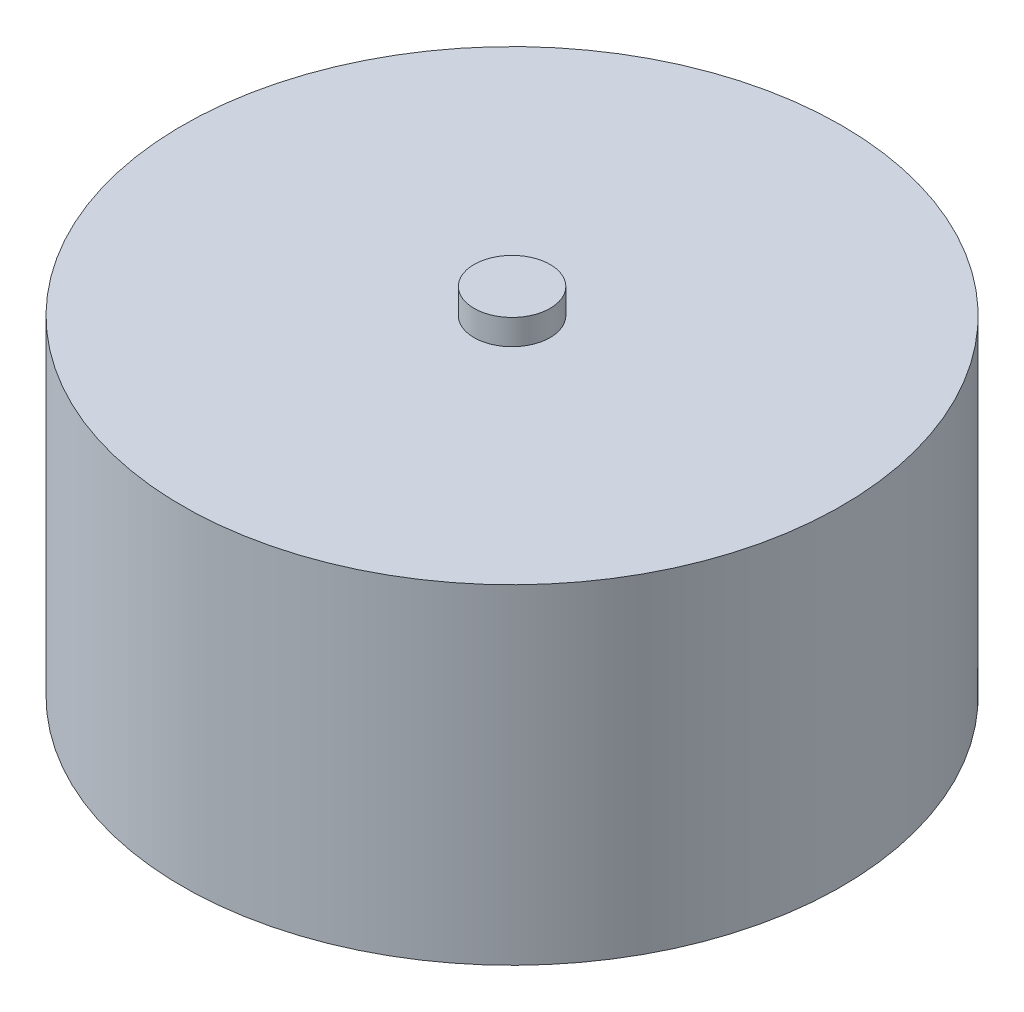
ISO-10303-21;
HEADER;
FILE_DESCRIPTION(('STEP AP214'),'2;1');
FILE_NAME('part.step','',(''),(''),'','','');
FILE_SCHEMA(('AUTOMOTIVE_DESIGN { 1 0 10303 214 1 1 1 1 }'));
ENDSEC;
DATA;
#1=APPLICATION_CONTEXT('core data for automotive mechanical design processes');
#2=APPLICATION_PROTOCOL_DEFINITION('international standard','automotive_design',2000,#1);
#3=PRODUCT_CONTEXT('',#1,'mechanical');
#4=PRODUCT('Part','Part','',(#3));
#5=PRODUCT_RELATED_PRODUCT_CATEGORY('part','',(#4));
#6=PRODUCT_DEFINITION_FORMATION('','',#4);
#7=PRODUCT_DEFINITION_CONTEXT('part definition',#1,'design');
#8=PRODUCT_DEFINITION('design','',#6,#7);
#9=PRODUCT_DEFINITION_SHAPE('','',#8);
#10=(LENGTH_UNIT() NAMED_UNIT(*) SI_UNIT(.MILLI.,.METRE.));
#11=(NAMED_UNIT(*) PLANE_ANGLE_UNIT() SI_UNIT($,.RADIAN.));
#12=(NAMED_UNIT(*) SI_UNIT($,.STERADIAN.) SOLID_ANGLE_UNIT());
#13=UNCERTAINTY_MEASURE_WITH_UNIT(LENGTH_MEASURE(1.E-05),#10,'distance_accuracy_value','');
#14=(GEOMETRIC_REPRESENTATION_CONTEXT(3) GLOBAL_UNCERTAINTY_ASSIGNED_CONTEXT((#13)) GLOBAL_UNIT_ASSIGNED_CONTEXT((#10,
#11,#12)) REPRESENTATION_CONTEXT('',''));
#15=CARTESIAN_POINT('',(0.,0.,0.));
#16=DIRECTION('',(0.,0.,1.));
#17=DIRECTION('',(1.,0.,0.));
#18=AXIS2_PLACEMENT_3D('',#15,#16,#17);
#19=CARTESIAN_POINT('',(0.,6.5,0.));
#20=DIRECTION('',(0.,-1.,0.));
#21=DIRECTION('',(0.,0.,-1.));
#22=AXIS2_PLACEMENT_3D('',#19,#20,#21);
#23=CYLINDRICAL_SURFACE('',#22,6.5);
#24=CARTESIAN_POINT('',(0.,6.5,0.));
#25=DIRECTION('',(0.,1.,0.));
#26=DIRECTION('',(0.,0.,1.));
#27=AXIS2_PLACEMENT_3D('',#24,#25,#26);
#28=CIRCLE('',#27,6.5);
#29=CARTESIAN_POINT('',(0.,6.5,-6.5));
#30=VERTEX_POINT('',#29);
#31=EDGE_CURVE('E10',#30,#30,#28,.T.);
#32=CARTESIAN_POINT('',(0.,0.,0.));
#33=DIRECTION('',(0.,1.,0.));
#34=DIRECTION('',(0.,0.,1.));
#35=AXIS2_PLACEMENT_3D('',#32,#33,#34);
#36=CIRCLE('',#35,6.5);
#37=CARTESIAN_POINT('',(0.,0.,-6.5));
#38=VERTEX_POINT('',#37);
#39=EDGE_CURVE('E34',#38,#38,#36,.T.);
#40=CARTESIAN_POINT('',(0.,6.5,-6.5));
#41=CARTESIAN_POINT('',(0.,6.43229166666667,-6.5));
#42=CARTESIAN_POINT('',(0.,6.36458333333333,-6.5));
#43=CARTESIAN_POINT('',(0.,6.22916666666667,-6.5));
#44=CARTESIAN_POINT('',(0.,6.16145833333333,-6.5));
#45=CARTESIAN_POINT('',(0.,6.02604166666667,-6.5));
#46=CARTESIAN_POINT('',(0.,5.95833333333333,-6.5));
#47=CARTESIAN_POINT('',(0.,5.82291666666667,-6.5));
#48=CARTESIAN_POINT('',(0.,5.75520833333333,-6.5));
#49=CARTESIAN_POINT('',(0.,5.61979166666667,-6.5));
#50=CARTESIAN_POINT('',(0.,5.55208333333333,-6.5));
#51=CARTESIAN_POINT('',(0.,5.41666666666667,-6.5));
#52=CARTESIAN_POINT('',(0.,5.34895833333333,-6.5));
#53=CARTESIAN_POINT('',(0.,5.21354166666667,-6.5));
#54=CARTESIAN_POINT('',(0.,5.14583333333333,-6.5));
#55=CARTESIAN_POINT('',(0.,5.01041666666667,-6.5));
#56=CARTESIAN_POINT('',(0.,4.94270833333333,-6.5));
#57=CARTESIAN_POINT('',(0.,4.80729166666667,-6.5));
#58=CARTESIAN_POINT('',(0.,4.73958333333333,-6.5));
#59=CARTESIAN_POINT('',(0.,4.60416666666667,-6.5));
#60=CARTESIAN_POINT('',(0.,4.53645833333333,-6.5));
#61=CARTESIAN_POINT('',(0.,4.40104166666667,-6.5));
#62=CARTESIAN_POINT('',(0.,4.33333333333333,-6.5));
#63=CARTESIAN_POINT('',(0.,4.19791666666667,-6.5));
#64=CARTESIAN_POINT('',(0.,4.13020833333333,-6.5));
#65=CARTESIAN_POINT('',(0.,3.99479166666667,-6.5));
#66=CARTESIAN_POINT('',(0.,3.92708333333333,-6.5));
#67=CARTESIAN_POINT('',(0.,3.79166666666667,-6.5));
#68=CARTESIAN_POINT('',(0.,3.72395833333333,-6.5));
#69=CARTESIAN_POINT('',(0.,3.58854166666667,-6.5));
#70=CARTESIAN_POINT('',(0.,3.52083333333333,-6.5));
#71=CARTESIAN_POINT('',(0.,3.38541666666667,-6.5));
#72=CARTESIAN_POINT('',(0.,3.31770833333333,-6.5));
#73=CARTESIAN_POINT('',(0.,3.18229166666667,-6.5));
#74=CARTESIAN_POINT('',(0.,3.11458333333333,-6.5));
#75=CARTESIAN_POINT('',(0.,2.97916666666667,-6.5));
#76=CARTESIAN_POINT('',(0.,2.91145833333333,-6.5));
#77=CARTESIAN_POINT('',(0.,2.77604166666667,-6.5));
#78=CARTESIAN_POINT('',(0.,2.70833333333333,-6.5));
#79=CARTESIAN_POINT('',(0.,2.57291666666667,-6.5));
#80=CARTESIAN_POINT('',(0.,2.50520833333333,-6.5));
#81=CARTESIAN_POINT('',(0.,2.36979166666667,-6.5));
#82=CARTESIAN_POINT('',(0.,2.30208333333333,-6.5));
#83=CARTESIAN_POINT('',(0.,2.16666666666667,-6.5));
#84=CARTESIAN_POINT('',(0.,2.09895833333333,-6.5));
#85=CARTESIAN_POINT('',(0.,1.96354166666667,-6.5));
#86=CARTESIAN_POINT('',(0.,1.89583333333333,-6.5));
#87=CARTESIAN_POINT('',(0.,1.76041666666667,-6.5));
#88=CARTESIAN_POINT('',(0.,1.69270833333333,-6.5));
#89=CARTESIAN_POINT('',(0.,1.55729166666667,-6.5));
#90=CARTESIAN_POINT('',(0.,1.48958333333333,-6.5));
#91=CARTESIAN_POINT('',(0.,1.35416666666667,-6.5));
#92=CARTESIAN_POINT('',(0.,1.28645833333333,-6.5));
#93=CARTESIAN_POINT('',(0.,1.15104166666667,-6.5));
#94=CARTESIAN_POINT('',(0.,1.08333333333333,-6.5));
#95=CARTESIAN_POINT('',(0.,0.947916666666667,-6.5));
#96=CARTESIAN_POINT('',(0.,0.880208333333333,-6.5));
#97=CARTESIAN_POINT('',(0.,0.744791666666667,-6.5));
#98=CARTESIAN_POINT('',(0.,0.677083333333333,-6.5));
#99=CARTESIAN_POINT('',(0.,0.541666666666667,-6.5));
#100=CARTESIAN_POINT('',(0.,0.473958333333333,-6.5));
#101=CARTESIAN_POINT('',(0.,0.338541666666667,-6.5));
#102=CARTESIAN_POINT('',(0.,0.270833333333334,-6.5));
#103=CARTESIAN_POINT('',(0.,0.135416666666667,-6.5));
#104=CARTESIAN_POINT('',(0.,0.0677083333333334,-6.5));
#105=CARTESIAN_POINT('',(0.,0.,-6.5));
#106=B_SPLINE_CURVE_WITH_KNOTS('',3,(#40,#41,#42,#43,#44,#45,#46,#47,#48,#49,#50,#51,#52,#53,
#54,#55,#56,#57,#58,#59,#60,#61,#62,#63,#64,#65,#66,#67,#68,#69,#70,#71,#72,#73,#74,#75,#76,#77,
#78,#79,#80,#81,#82,#83,#84,#85,#86,#87,#88,#89,#90,#91,#92,#93,#94,#95,#96,#97,#98,#99,#100,
#101,#102,#103,#104,#105),.UNSPECIFIED.,.F.,.F.,(4,2,2,2,2,2,2,2,2,2,2,2,2,2,2,2,2,2,2,2,2,2,2,
2,2,2,2,2,2,2,2,2,4),(0.,0.203124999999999,0.40625,0.609375,0.812499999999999,1.015625,1.21875,
1.421875,1.625,1.828125,2.03125,2.234375,2.4375,2.640625,2.84375,3.046875,3.25,3.453125,3.65625,
3.859375,4.0625,4.265625,4.46875,4.671875,4.875,5.078125,5.28125,5.484375,5.6875,5.890625,
6.09375,6.296875,6.5),.UNSPECIFIED.);
#107=EDGE_CURVE('BSEAM31',#30,#38,#106,.T.);
#108=ORIENTED_EDGE('',*,*,#31,.F.);
#109=ORIENTED_EDGE('',*,*,#39,.T.);
#110=ORIENTED_EDGE('',*,*,#107,.T.);
#111=ORIENTED_EDGE('',*,*,#107,.F.);
#112=EDGE_LOOP('',(#108,#110,#109,#111));
#113=FACE_BOUND('',#112,.T.);
#114=ADVANCED_FACE('F31',(#113),#23,.T.);
#115=CARTESIAN_POINT('',(0.,6.5,0.));
#116=DIRECTION('',(0.,1.,0.));
#117=DIRECTION('',(0.,0.,1.));
#118=AXIS2_PLACEMENT_3D('',#115,#116,#117);
#119=PLANE('',#118);
#120=CARTESIAN_POINT('',(0.,6.5,0.));
#121=DIRECTION('',(0.,1.,0.));
#122=DIRECTION('',(0.,0.,1.));
#123=AXIS2_PLACEMENT_3D('',#120,#121,#122);
#124=CIRCLE('',#123,0.75);
#125=CARTESIAN_POINT('',(0.,6.5,0.75));
#126=VERTEX_POINT('',#125);
#127=EDGE_CURVE('E43',#126,#126,#124,.T.);
#128=ORIENTED_EDGE('',*,*,#127,.F.);
#129=EDGE_LOOP('',(#128));
#130=FACE_BOUND('',#129,.T.);
#131=ORIENTED_EDGE('',*,*,#31,.T.);
#132=EDGE_LOOP('',(#131));
#133=FACE_BOUND('',#132,.T.);
#134=ADVANCED_FACE('F58',(#130,#133),#119,.T.);
#135=CARTESIAN_POINT('',(0.,0.,0.));
#136=DIRECTION('',(0.,1.,0.));
#137=DIRECTION('',(0.,0.,1.));
#138=AXIS2_PLACEMENT_3D('',#135,#136,#137);
#139=PLANE('',#138);
#140=ORIENTED_EDGE('',*,*,#39,.F.);
#141=EDGE_LOOP('',(#140));
#142=FACE_BOUND('',#141,.T.);
#143=ADVANCED_FACE('F54',(#142),#139,.F.);
#144=CARTESIAN_POINT('',(0.,7.,0.));
#145=DIRECTION('',(0.,-1.,0.));
#146=DIRECTION('',(0.,0.,-1.));
#147=AXIS2_PLACEMENT_3D('',#144,#145,#146);
#148=CYLINDRICAL_SURFACE('',#147,0.75);
#149=CARTESIAN_POINT('',(0.,7.,0.));
#150=DIRECTION('',(0.,1.,0.));
#151=DIRECTION('',(0.,0.,1.));
#152=AXIS2_PLACEMENT_3D('',#149,#150,#151);
#153=CIRCLE('',#152,0.75);
#154=CARTESIAN_POINT('',(0.,7.,0.75));
#155=VERTEX_POINT('',#154);
#156=EDGE_CURVE('E41',#155,#155,#153,.T.);
#157=ORIENTED_EDGE('',*,*,#156,.F.);
#158=EDGE_LOOP('',(#157));
#159=FACE_BOUND('',#158,.T.);
#160=ORIENTED_EDGE('',*,*,#127,.T.);
#161=EDGE_LOOP('',(#160));
#162=FACE_BOUND('',#161,.T.);
#163=ADVANCED_FACE('F51',(#159,#162),#148,.T.);
#164=CARTESIAN_POINT('',(0.,7.,0.));
#165=DIRECTION('',(0.,1.,0.));
#166=DIRECTION('',(0.,0.,1.));
#167=AXIS2_PLACEMENT_3D('',#164,#165,#166);
#168=PLANE('',#167);
#169=ORIENTED_EDGE('',*,*,#156,.T.);
#170=EDGE_LOOP('',(#169));
#171=FACE_BOUND('',#170,.T.);
#172=ADVANCED_FACE('F49',(#171),#168,.T.);
#173=CLOSED_SHELL('',(#114,#134,#143,#163,#172));
#174=MANIFOLD_SOLID_BREP('B2',#173);
#175=ADVANCED_BREP_SHAPE_REPRESENTATION('',(#18,#174),#14);
#176=SHAPE_DEFINITION_REPRESENTATION(#9,#175);
ENDSEC;
END-ISO-10303-21;
